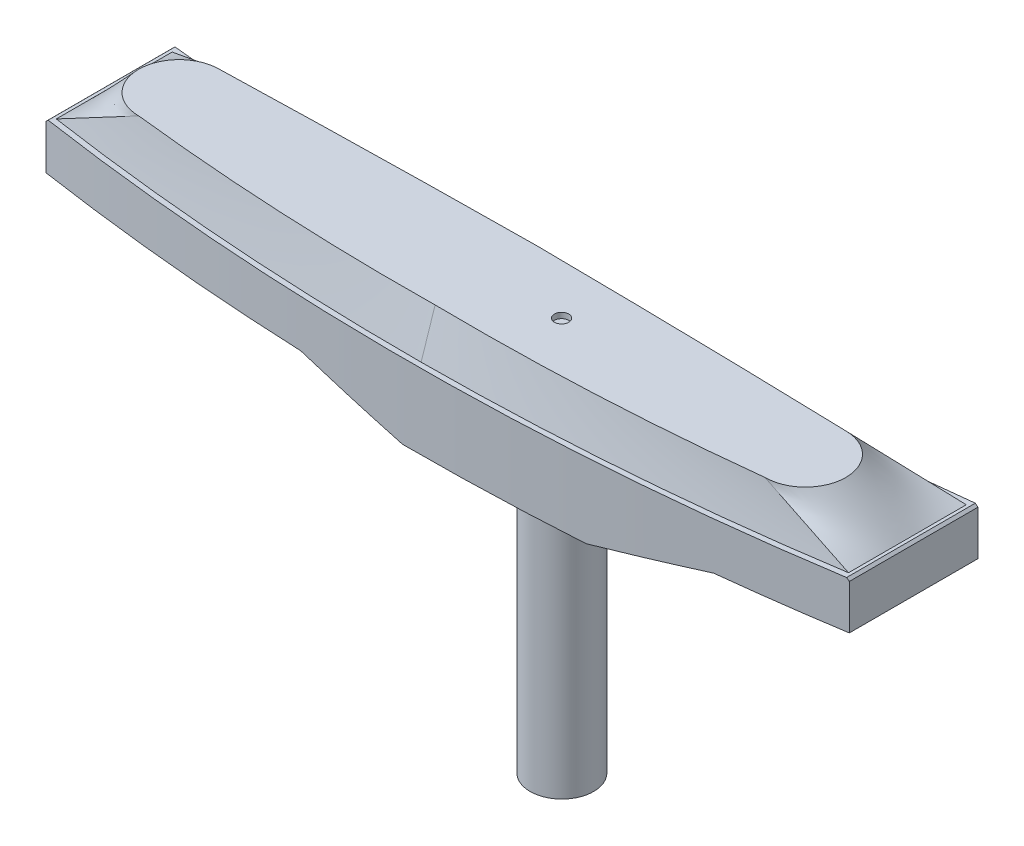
ISO-10303-21;
HEADER;
FILE_DESCRIPTION(('STEP AP214'),'2;1');
FILE_NAME('part.step','',(''),(''),'','','');
FILE_SCHEMA(('AUTOMOTIVE_DESIGN { 1 0 10303 214 1 1 1 1 }'));
ENDSEC;
DATA;
#1=APPLICATION_CONTEXT('core data for automotive mechanical design processes');
#2=APPLICATION_PROTOCOL_DEFINITION('international standard','automotive_design',2000,#1);
#3=PRODUCT_CONTEXT('',#1,'mechanical');
#4=PRODUCT('Part','Part','',(#3));
#5=PRODUCT_RELATED_PRODUCT_CATEGORY('part','',(#4));
#6=PRODUCT_DEFINITION_FORMATION('','',#4);
#7=PRODUCT_DEFINITION_CONTEXT('part definition',#1,'design');
#8=PRODUCT_DEFINITION('design','',#6,#7);
#9=PRODUCT_DEFINITION_SHAPE('','',#8);
#10=(LENGTH_UNIT() NAMED_UNIT(*) SI_UNIT(.MILLI.,.METRE.));
#11=(NAMED_UNIT(*) PLANE_ANGLE_UNIT() SI_UNIT($,.RADIAN.));
#12=(NAMED_UNIT(*) SI_UNIT($,.STERADIAN.) SOLID_ANGLE_UNIT());
#13=UNCERTAINTY_MEASURE_WITH_UNIT(LENGTH_MEASURE(1.E-05),#10,'distance_accuracy_value','');
#14=(GEOMETRIC_REPRESENTATION_CONTEXT(3) GLOBAL_UNCERTAINTY_ASSIGNED_CONTEXT((#13)) GLOBAL_UNIT_ASSIGNED_CONTEXT((#10,
#11,#12)) REPRESENTATION_CONTEXT('',''));
#15=CARTESIAN_POINT('',(0.,0.,0.));
#16=DIRECTION('',(0.,0.,1.));
#17=DIRECTION('',(1.,0.,0.));
#18=AXIS2_PLACEMENT_3D('',#15,#16,#17);
#19=CARTESIAN_POINT('',(89.4617446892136,128.447272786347,-41.));
#20=DIRECTION('',(0.,-1.,0.));
#21=DIRECTION('',(0.,0.,1.));
#22=AXIS2_PLACEMENT_3D('',#19,#20,#21);
#23=PLANE('',#22);
#24=DIRECTION('',(0.,0.,1.));
#25=VECTOR('',#24,1.);
#26=CARTESIAN_POINT('',(89.4617446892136,128.447272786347,-41.));
#27=LINE('',#26,#25);
#28=CARTESIAN_POINT('',(89.4617446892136,128.447272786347,-34.2392456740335));
#29=VERTEX_POINT('',#28);
#30=CARTESIAN_POINT('',(89.4617446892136,128.447272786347,-9.71667776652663));
#31=VERTEX_POINT('',#30);
#32=EDGE_CURVE('E262',#29,#31,#27,.T.);
#33=ORIENTED_EDGE('',*,*,#32,.F.);
#34=CARTESIAN_POINT('',(88.1460786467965,128.447272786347,-664.5294804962));
#35=DIRECTION('',(0.,1.,0.));
#36=DIRECTION('',(0.,0.,1.));
#37=AXIS2_PLACEMENT_3D('',#34,#35,#36);
#38=CIRCLE('',#37,630.291607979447);
#39=CARTESIAN_POINT('',(121.725900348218,128.447272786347,-35.1330182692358));
#40=VERTEX_POINT('',#39);
#41=EDGE_CURVE('E249',#29,#40,#38,.T.);
#42=ORIENTED_EDGE('',*,*,#41,.T.);
#43=DIRECTION('',(0.,0.,1.));
#44=VECTOR('',#43,1.);
#45=CARTESIAN_POINT('',(121.725900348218,128.447272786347,-41.));
#46=LINE('',#45,#44);
#47=CARTESIAN_POINT('',(121.725900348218,128.447272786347,-10.7554225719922));
#48=VERTEX_POINT('',#47);
#49=EDGE_CURVE('E265',#40,#48,#46,.T.);
#50=ORIENTED_EDGE('',*,*,#49,.T.);
#51=CARTESIAN_POINT('',(90.2256837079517,128.447272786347,-487.581419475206));
#52=DIRECTION('',(0.,1.,0.));
#53=DIRECTION('',(0.,0.,1.));
#54=AXIS2_PLACEMENT_3D('',#51,#52,#53);
#55=CIRCLE('',#54,477.865352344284);
#56=EDGE_CURVE('E231',#48,#31,#55,.F.);
#57=ORIENTED_EDGE('',*,*,#56,.T.);
#58=EDGE_LOOP('',(#33,#42,#50,#57));
#59=FACE_BOUND('',#58,.T.);
#60=CARTESIAN_POINT('',(105.593822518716,128.447272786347,-22.4973341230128));
#61=DIRECTION('',(0.,1.,0.));
#62=DIRECTION('',(0.,0.,1.));
#63=AXIS2_PLACEMENT_3D('',#60,#61,#62);
#64=CIRCLE('',#63,5.77113497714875);
#65=CARTESIAN_POINT('',(105.593822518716,128.447272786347,-16.7261991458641));
#66=VERTEX_POINT('',#65);
#67=EDGE_CURVE('E428',#66,#66,#64,.T.);
#68=ORIENTED_EDGE('',*,*,#67,.T.);
#69=EDGE_LOOP('',(#68));
#70=FACE_BOUND('',#69,.T.);
#71=ADVANCED_FACE('F34',(#59,#70),#23,.T.);
#72=CARTESIAN_POINT('',(28.1748364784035,150.036801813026,-40.));
#73=DIRECTION('',(-0.697545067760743,0.716540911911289,0.));
#74=DIRECTION('',(0.716540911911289,0.697545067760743,0.));
#75=AXIS2_PLACEMENT_3D('',#72,#73,#74);
#76=PLANE('',#75);
#77=DIRECTION('',(0.,0.,-1.));
#78=VECTOR('',#77,1.);
#79=CARTESIAN_POINT('',(19.956977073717,142.036801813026,-40.));
#80=LINE('',#79,#78);
#81=CARTESIAN_POINT('',(19.956977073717,142.036801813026,-14.9107055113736));
#82=VERTEX_POINT('',#81);
#83=CARTESIAN_POINT('',(19.956977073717,142.036801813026,-37.9373025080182));
#84=VERTEX_POINT('',#83);
#85=EDGE_CURVE('E205',#82,#84,#80,.T.);
#86=ORIENTED_EDGE('',*,*,#85,.T.);
#87=CARTESIAN_POINT('',(88.1460786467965,208.418177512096,-664.5294804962));
#88=DIRECTION('',(0.697545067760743,-0.716540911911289,0.));
#89=DIRECTION('',(0.716540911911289,0.697545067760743,0.));
#90=AXIS2_PLACEMENT_3D('',#87,#88,#89);
#91=ELLIPSE('',#90,879.631012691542,630.291607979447);
#92=CARTESIAN_POINT('',(19.503823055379,141.59566112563,-37.9867829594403));
#93=VERTEX_POINT('',#92);
#94=EDGE_CURVE('E216',#84,#93,#91,.T.);
#95=ORIENTED_EDGE('',*,*,#94,.T.);
#96=DIRECTION('',(0.,0.,1.));
#97=VECTOR('',#96,1.);
#98=CARTESIAN_POINT('',(19.503823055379,141.59566112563,-40.));
#99=LINE('',#98,#97);
#100=CARTESIAN_POINT('',(19.503823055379,141.59566112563,-14.9782948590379));
#101=VERTEX_POINT('',#100);
#102=EDGE_CURVE('E42',#93,#101,#99,.T.);
#103=ORIENTED_EDGE('',*,*,#102,.T.);
#104=CARTESIAN_POINT('',(90.2256837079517,210.442651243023,-487.581419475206));
#105=DIRECTION('',(0.697545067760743,-0.716540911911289,0.));
#106=DIRECTION('',(0.716540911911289,0.697545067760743,0.));
#107=AXIS2_PLACEMENT_3D('',#104,#105,#106);
#108=ELLIPSE('',#107,666.905886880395,477.865352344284);
#109=EDGE_CURVE('E219',#101,#82,#108,.F.);
#110=ORIENTED_EDGE('',*,*,#109,.T.);
#111=EDGE_LOOP('',(#86,#95,#103,#110));
#112=FACE_BOUND('',#111,.T.);
#113=ADVANCED_FACE('F36',(#112),#76,.T.);
#114=CARTESIAN_POINT('',(164.696110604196,141.59566112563,-40.));
#115=DIRECTION('',(0.716540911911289,0.697545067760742,0.));
#116=DIRECTION('',(0.697545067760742,-0.716540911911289,0.));
#117=AXIS2_PLACEMENT_3D('',#114,#115,#116);
#118=PLANE('',#117);
#119=DIRECTION('',(0.,0.,1.));
#120=VECTOR('',#119,1.);
#121=CARTESIAN_POINT('',(164.266664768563,142.036801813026,-40.));
#122=LINE('',#121,#120);
#123=CARTESIAN_POINT('',(164.266664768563,142.036801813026,-38.8513144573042));
#124=VERTEX_POINT('',#123);
#125=CARTESIAN_POINT('',(164.266664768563,142.036801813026,-15.4869076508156));
#126=VERTEX_POINT('',#125);
#127=EDGE_CURVE('E197',#124,#126,#122,.T.);
#128=ORIENTED_EDGE('',*,*,#127,.T.);
#129=CARTESIAN_POINT('',(90.2256837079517,218.09409838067,-487.581419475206));
#130=DIRECTION('',(-0.716540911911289,-0.697545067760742,0.));
#131=DIRECTION('',(-0.697545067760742,0.716540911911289,0.));
#132=AXIS2_PLACEMENT_3D('',#129,#130,#131);
#133=ELLIPSE('',#132,685.067351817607,477.865352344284);
#134=CARTESIAN_POINT('',(164.696110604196,141.59566112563,-15.5544599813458));
#135=VERTEX_POINT('',#134);
#136=EDGE_CURVE('E213',#126,#135,#133,.F.);
#137=ORIENTED_EDGE('',*,*,#136,.T.);
#138=DIRECTION('',(0.,0.,1.));
#139=VECTOR('',#138,1.);
#140=CARTESIAN_POINT('',(164.696110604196,141.59566112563,-40.));
#141=LINE('',#140,#139);
#142=CARTESIAN_POINT('',(164.696110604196,141.59566112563,-38.9037108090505));
#143=VERTEX_POINT('',#142);
#144=EDGE_CURVE('E258',#143,#135,#141,.T.);
#145=ORIENTED_EDGE('',*,*,#144,.F.);
#146=CARTESIAN_POINT('',(88.1460786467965,220.230336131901,-664.5294804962));
#147=DIRECTION('',(-0.716540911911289,-0.697545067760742,0.));
#148=DIRECTION('',(-0.697545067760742,0.716540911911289,0.));
#149=AXIS2_PLACEMENT_3D('',#146,#147,#148);
#150=ELLIPSE('',#149,903.585498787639,630.291607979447);
#151=EDGE_CURVE('E210',#143,#124,#150,.T.);
#152=ORIENTED_EDGE('',*,*,#151,.T.);
#153=EDGE_LOOP('',(#128,#137,#145,#152));
#154=FACE_BOUND('',#153,.T.);
#155=ADVANCED_FACE('F287',(#154),#118,.T.);
#156=CARTESIAN_POINT('',(164.696110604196,133.502486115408,-41.));
#157=DIRECTION('',(1.,0.,0.));
#158=DIRECTION('',(0.,0.,-1.));
#159=AXIS2_PLACEMENT_3D('',#156,#157,#158);
#160=PLANE('',#159);
#161=DIRECTION('',(0.,0.,1.));
#162=VECTOR('',#161,1.);
#163=CARTESIAN_POINT('',(164.696110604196,133.502486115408,-41.));
#164=LINE('',#163,#162);
#165=CARTESIAN_POINT('',(164.696110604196,133.502486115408,-38.9037108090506));
#166=VERTEX_POINT('',#165);
#167=CARTESIAN_POINT('',(164.696110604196,133.502486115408,-15.5544599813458));
#168=VERTEX_POINT('',#167);
#169=EDGE_CURVE('E254',#166,#168,#164,.T.);
#170=ORIENTED_EDGE('',*,*,#169,.F.);
#171=DIRECTION('',(0.,1.,0.));
#172=VECTOR('',#171,1.);
#173=CARTESIAN_POINT('',(164.696110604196,128.446272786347,-38.9037108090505));
#174=LINE('',#173,#172);
#175=EDGE_CURVE('E240',#166,#143,#174,.T.);
#176=ORIENTED_EDGE('',*,*,#175,.T.);
#177=ORIENTED_EDGE('',*,*,#144,.T.);
#178=DIRECTION('',(0.,1.,0.));
#179=VECTOR('',#178,1.);
#180=CARTESIAN_POINT('',(164.696110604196,128.446272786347,-15.5544599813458));
#181=LINE('',#180,#179);
#182=EDGE_CURVE('E237',#168,#135,#181,.T.);
#183=ORIENTED_EDGE('',*,*,#182,.F.);
#184=EDGE_LOOP('',(#170,#176,#177,#183));
#185=FACE_BOUND('',#184,.T.);
#186=ADVANCED_FACE('F283',(#185),#160,.T.);
#187=CARTESIAN_POINT('',(19.503823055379,141.59566112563,-41.));
#188=DIRECTION('',(-1.,0.,0.));
#189=DIRECTION('',(0.,1.,0.));
#190=AXIS2_PLACEMENT_3D('',#187,#188,#189);
#191=PLANE('',#190);
#192=ORIENTED_EDGE('',*,*,#102,.F.);
#193=DIRECTION('',(0.,1.,0.));
#194=VECTOR('',#193,1.);
#195=CARTESIAN_POINT('',(19.503823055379,128.446272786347,-37.9867829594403));
#196=LINE('',#195,#194);
#197=CARTESIAN_POINT('',(19.503823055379,133.502486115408,-37.9867829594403));
#198=VERTEX_POINT('',#197);
#199=EDGE_CURVE('E242',#198,#93,#196,.T.);
#200=ORIENTED_EDGE('',*,*,#199,.F.);
#201=DIRECTION('',(0.,0.,1.));
#202=VECTOR('',#201,1.);
#203=CARTESIAN_POINT('',(19.503823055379,133.502486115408,-41.));
#204=LINE('',#203,#202);
#205=CARTESIAN_POINT('',(19.503823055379,133.502486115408,-14.9782948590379));
#206=VERTEX_POINT('',#205);
#207=EDGE_CURVE('E255',#198,#206,#204,.T.);
#208=ORIENTED_EDGE('',*,*,#207,.T.);
#209=DIRECTION('',(0.,1.,0.));
#210=VECTOR('',#209,1.);
#211=CARTESIAN_POINT('',(19.503823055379,128.446272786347,-14.9782948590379));
#212=LINE('',#211,#210);
#213=EDGE_CURVE('E236',#206,#101,#212,.T.);
#214=ORIENTED_EDGE('',*,*,#213,.T.);
#215=EDGE_LOOP('',(#192,#200,#208,#214));
#216=FACE_BOUND('',#215,.T.);
#217=ADVANCED_FACE('F306',(#216),#191,.T.);
#218=CARTESIAN_POINT('',(19.503823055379,133.502486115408,-41.));
#219=DIRECTION('',(0.,-1.,0.));
#220=DIRECTION('',(0.,0.,1.));
#221=AXIS2_PLACEMENT_3D('',#218,#219,#220);
#222=PLANE('',#221);
#223=ORIENTED_EDGE('',*,*,#207,.F.);
#224=CARTESIAN_POINT('',(88.1460786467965,133.502486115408,-664.5294804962));
#225=DIRECTION('',(0.,1.,0.));
#226=DIRECTION('',(0.,0.,1.));
#227=AXIS2_PLACEMENT_3D('',#224,#225,#226);
#228=CIRCLE('',#227,630.291607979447);
#229=CARTESIAN_POINT('',(70.5790360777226,133.502486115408,-34.482728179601));
#230=VERTEX_POINT('',#229);
#231=EDGE_CURVE('E222',#198,#230,#228,.T.);
#232=ORIENTED_EDGE('',*,*,#231,.T.);
#233=DIRECTION('',(0.,0.,1.));
#234=VECTOR('',#233,1.);
#235=CARTESIAN_POINT('',(70.5790360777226,133.502486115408,-41.));
#236=LINE('',#235,#234);
#237=CARTESIAN_POINT('',(70.5790360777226,133.502486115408,-10.1201077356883));
#238=VERTEX_POINT('',#237);
#239=EDGE_CURVE('E259',#230,#238,#236,.T.);
#240=ORIENTED_EDGE('',*,*,#239,.T.);
#241=CARTESIAN_POINT('',(90.2256837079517,133.502486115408,-487.581419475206));
#242=DIRECTION('',(0.,1.,0.));
#243=DIRECTION('',(0.,0.,1.));
#244=AXIS2_PLACEMENT_3D('',#241,#242,#243);
#245=CIRCLE('',#244,477.865352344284);
#246=EDGE_CURVE('E225',#238,#206,#245,.F.);
#247=ORIENTED_EDGE('',*,*,#246,.T.);
#248=EDGE_LOOP('',(#223,#232,#240,#247));
#249=FACE_BOUND('',#248,.T.);
#250=ADVANCED_FACE('F308',(#249),#222,.T.);
#251=CARTESIAN_POINT('',(70.5790360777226,133.502486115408,-41.));
#252=DIRECTION('',(-0.25860935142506,-0.965981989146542,0.));
#253=DIRECTION('',(-0.965981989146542,0.25860935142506,0.));
#254=AXIS2_PLACEMENT_3D('',#251,#252,#253);
#255=PLANE('',#254);
#256=ORIENTED_EDGE('',*,*,#239,.F.);
#257=CARTESIAN_POINT('',(88.1460786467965,128.79949834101,-664.5294804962));
#258=DIRECTION('',(0.25860935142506,0.965981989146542,0.));
#259=DIRECTION('',(-0.965981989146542,0.25860935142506,0.));
#260=AXIS2_PLACEMENT_3D('',#257,#258,#259);
#261=ELLIPSE('',#260,652.48795014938,630.291607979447);
#262=EDGE_CURVE('E252',#230,#29,#261,.T.);
#263=ORIENTED_EDGE('',*,*,#262,.T.);
#264=ORIENTED_EDGE('',*,*,#32,.T.);
#265=CARTESIAN_POINT('',(90.2256837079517,128.242753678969,-487.581419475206));
#266=DIRECTION('',(0.25860935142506,0.965981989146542,0.));
#267=DIRECTION('',(-0.965981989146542,0.25860935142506,0.));
#268=AXIS2_PLACEMENT_3D('',#265,#266,#267);
#269=ELLIPSE('',#268,494.693853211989,477.865352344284);
#270=EDGE_CURVE('E234',#31,#238,#269,.F.);
#271=ORIENTED_EDGE('',*,*,#270,.T.);
#272=EDGE_LOOP('',(#256,#263,#264,#271));
#273=FACE_BOUND('',#272,.T.);
#274=ADVANCED_FACE('F311',(#273),#255,.T.);
#275=CARTESIAN_POINT('',(121.725900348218,128.447272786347,-41.));
#276=DIRECTION('',(0.231313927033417,-0.972879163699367,0.));
#277=DIRECTION('',(-0.972879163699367,-0.231313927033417,0.));
#278=AXIS2_PLACEMENT_3D('',#275,#276,#277);
#279=PLANE('',#278);
#280=ORIENTED_EDGE('',*,*,#49,.F.);
#281=CARTESIAN_POINT('',(88.1460786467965,120.46325923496,-664.5294804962));
#282=DIRECTION('',(-0.231313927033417,0.972879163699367,0.));
#283=DIRECTION('',(0.972879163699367,0.231313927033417,0.));
#284=AXIS2_PLACEMENT_3D('',#281,#282,#283);
#285=ELLIPSE('',#284,647.862171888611,630.291607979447);
#286=CARTESIAN_POINT('',(142.987532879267,133.502486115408,-36.628273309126));
#287=VERTEX_POINT('',#286);
#288=EDGE_CURVE('E246',#40,#287,#285,.T.);
#289=ORIENTED_EDGE('',*,*,#288,.T.);
#290=DIRECTION('',(0.,0.,1.));
#291=VECTOR('',#290,1.);
#292=CARTESIAN_POINT('',(142.987532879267,133.502486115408,-41.));
#293=LINE('',#292,#291);
#294=CARTESIAN_POINT('',(142.987532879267,133.502486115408,-12.6377572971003));
#295=VERTEX_POINT('',#294);
#296=EDGE_CURVE('E268',#287,#295,#293,.T.);
#297=ORIENTED_EDGE('',*,*,#296,.T.);
#298=CARTESIAN_POINT('',(90.2256837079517,120.957710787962,-487.581419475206));
#299=DIRECTION('',(-0.231313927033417,0.972879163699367,0.));
#300=DIRECTION('',(0.972879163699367,0.231313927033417,0.));
#301=AXIS2_PLACEMENT_3D('',#298,#299,#300);
#302=ELLIPSE('',#301,491.186747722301,477.865352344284);
#303=EDGE_CURVE('E229',#295,#48,#302,.F.);
#304=ORIENTED_EDGE('',*,*,#303,.T.);
#305=EDGE_LOOP('',(#280,#289,#297,#304));
#306=FACE_BOUND('',#305,.T.);
#307=ADVANCED_FACE('F318',(#306),#279,.T.);
#308=CARTESIAN_POINT('',(142.987532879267,133.502486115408,-41.));
#309=DIRECTION('',(0.,-1.,0.));
#310=DIRECTION('',(0.,0.,1.));
#311=AXIS2_PLACEMENT_3D('',#308,#309,#310);
#312=PLANE('',#311);
#313=ORIENTED_EDGE('',*,*,#296,.F.);
#314=CARTESIAN_POINT('',(88.1460786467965,133.502486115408,-664.5294804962));
#315=DIRECTION('',(0.,1.,0.));
#316=DIRECTION('',(0.,0.,1.));
#317=AXIS2_PLACEMENT_3D('',#314,#315,#316);
#318=CIRCLE('',#317,630.291607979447);
#319=EDGE_CURVE('E239',#287,#166,#318,.T.);
#320=ORIENTED_EDGE('',*,*,#319,.T.);
#321=ORIENTED_EDGE('',*,*,#169,.T.);
#322=CARTESIAN_POINT('',(90.2256837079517,133.502486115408,-487.581419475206));
#323=DIRECTION('',(0.,1.,0.));
#324=DIRECTION('',(0.,0.,1.));
#325=AXIS2_PLACEMENT_3D('',#322,#323,#324);
#326=CIRCLE('',#325,477.865352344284);
#327=EDGE_CURVE('E227',#168,#295,#326,.F.);
#328=ORIENTED_EDGE('',*,*,#327,.T.);
#329=EDGE_LOOP('',(#313,#320,#321,#328));
#330=FACE_BOUND('',#329,.T.);
#331=ADVANCED_FACE('F295',(#330),#312,.T.);
#332=CARTESIAN_POINT('',(88.1460786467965,128.446272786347,-664.5294804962));
#333=DIRECTION('',(0.,1.,0.));
#334=DIRECTION('',(1.,0.,0.));
#335=AXIS2_PLACEMENT_3D('',#332,#333,#334);
#336=CYLINDRICAL_SURFACE('',#335,630.291607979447);
#337=CARTESIAN_POINT('',(88.1460786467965,142.036801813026,-664.5294804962));
#338=DIRECTION('',(0.,1.,0.));
#339=DIRECTION('',(-1.,0.,0.));
#340=AXIS2_PLACEMENT_3D('',#337,#338,#339);
#341=CIRCLE('',#340,630.291607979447);
#342=EDGE_CURVE('E208',#84,#124,#341,.T.);
#343=ORIENTED_EDGE('',*,*,#342,.T.);
#344=ORIENTED_EDGE('',*,*,#151,.F.);
#345=ORIENTED_EDGE('',*,*,#175,.F.);
#346=ORIENTED_EDGE('',*,*,#319,.F.);
#347=ORIENTED_EDGE('',*,*,#288,.F.);
#348=ORIENTED_EDGE('',*,*,#41,.F.);
#349=ORIENTED_EDGE('',*,*,#262,.F.);
#350=ORIENTED_EDGE('',*,*,#231,.F.);
#351=ORIENTED_EDGE('',*,*,#199,.T.);
#352=ORIENTED_EDGE('',*,*,#94,.F.);
#353=EDGE_LOOP('',(#343,#344,#345,#346,#347,#348,#349,#350,#351,#352));
#354=FACE_BOUND('',#353,.T.);
#355=ADVANCED_FACE('F297',(#354),#336,.F.);
#356=CARTESIAN_POINT('',(90.2256837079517,128.446272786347,-487.581419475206));
#357=DIRECTION('',(0.,1.,0.));
#358=DIRECTION('',(1.,0.,0.));
#359=AXIS2_PLACEMENT_3D('',#356,#357,#358);
#360=CYLINDRICAL_SURFACE('',#359,477.865352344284);
#361=CARTESIAN_POINT('',(90.2256837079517,142.036801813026,-487.581419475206));
#362=DIRECTION('',(0.,1.,0.));
#363=DIRECTION('',(-1.,0.,0.));
#364=AXIS2_PLACEMENT_3D('',#361,#362,#363);
#365=CIRCLE('',#364,477.865352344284);
#366=EDGE_CURVE('E11',#126,#82,#365,.F.);
#367=ORIENTED_EDGE('',*,*,#366,.T.);
#368=ORIENTED_EDGE('',*,*,#109,.F.);
#369=ORIENTED_EDGE('',*,*,#213,.F.);
#370=ORIENTED_EDGE('',*,*,#246,.F.);
#371=ORIENTED_EDGE('',*,*,#270,.F.);
#372=ORIENTED_EDGE('',*,*,#56,.F.);
#373=ORIENTED_EDGE('',*,*,#303,.F.);
#374=ORIENTED_EDGE('',*,*,#327,.F.);
#375=ORIENTED_EDGE('',*,*,#182,.T.);
#376=ORIENTED_EDGE('',*,*,#136,.F.);
#377=EDGE_LOOP('',(#367,#368,#369,#370,#371,#372,#373,#374,#375,#376));
#378=FACE_BOUND('',#377,.T.);
#379=ADVANCED_FACE('F289',(#378),#360,.T.);
#380=CARTESIAN_POINT('',(8.4284544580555,142.036801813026,8.59458058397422));
#381=DIRECTION('',(0.,-1.,0.));
#382=DIRECTION('',(-1.,0.,0.));
#383=AXIS2_PLACEMENT_3D('',#380,#381,#382);
#384=PLANE('',#383);
#385=DIRECTION('',(0.,0.,-1.));
#386=VECTOR('',#385,1.);
#387=CARTESIAN_POINT('',(20.503823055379,142.036801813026,-15.840572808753));
#388=LINE('',#387,#386);
#389=CARTESIAN_POINT('',(20.503823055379,142.036801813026,-15.840572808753));
#390=VERTEX_POINT('',#389);
#391=CARTESIAN_POINT('',(20.503823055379,142.036801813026,-36.8722336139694));
#392=VERTEX_POINT('',#391);
#393=EDGE_CURVE('E165',#390,#392,#388,.T.);
#394=ORIENTED_EDGE('',*,*,#393,.T.);
#395=CARTESIAN_POINT('',(88.1460786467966,142.036801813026,-664.529480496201));
#396=DIRECTION('',(0.,1.,0.));
#397=DIRECTION('',(-1.,0.,0.));
#398=AXIS2_PLACEMENT_3D('',#395,#396,#397);
#399=CIRCLE('',#398,631.291607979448);
#400=CARTESIAN_POINT('',(91.8391258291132,142.036801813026,-33.2486747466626));
#401=VERTEX_POINT('',#400);
#402=EDGE_CURVE('E173',#392,#401,#399,.T.);
#403=ORIENTED_EDGE('',*,*,#402,.T.);
#404=CARTESIAN_POINT('',(163.696110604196,142.036801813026,-37.7749137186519));
#405=VERTEX_POINT('',#404);
#406=EDGE_CURVE('E177',#401,#405,#399,.T.);
#407=ORIENTED_EDGE('',*,*,#406,.T.);
#408=DIRECTION('',(0.,0.,1.));
#409=VECTOR('',#408,1.);
#410=CARTESIAN_POINT('',(163.696110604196,142.036801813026,-16.4098364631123));
#411=LINE('',#410,#409);
#412=CARTESIAN_POINT('',(163.696110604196,142.036801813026,-16.4098364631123));
#413=VERTEX_POINT('',#412);
#414=EDGE_CURVE('E182',#405,#413,#411,.T.);
#415=ORIENTED_EDGE('',*,*,#414,.T.);
#416=CARTESIAN_POINT('',(90.2256837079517,142.036801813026,-487.581419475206));
#417=DIRECTION('',(0.,-1.,0.));
#418=DIRECTION('',(-1.,0.,0.));
#419=AXIS2_PLACEMENT_3D('',#416,#417,#418);
#420=CIRCLE('',#419,476.865352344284);
#421=CARTESIAN_POINT('',(91.8352158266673,142.036801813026,-10.7187834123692));
#422=VERTEX_POINT('',#421);
#423=EDGE_CURVE('E168',#413,#422,#420,.T.);
#424=ORIENTED_EDGE('',*,*,#423,.T.);
#425=EDGE_CURVE('E150',#422,#390,#420,.T.);
#426=ORIENTED_EDGE('',*,*,#425,.T.);
#427=EDGE_LOOP('',(#394,#403,#407,#415,#424,#426));
#428=FACE_BOUND('',#427,.T.);
#429=ORIENTED_EDGE('',*,*,#342,.F.);
#430=ORIENTED_EDGE('',*,*,#85,.F.);
#431=ORIENTED_EDGE('',*,*,#366,.F.);
#432=ORIENTED_EDGE('',*,*,#127,.F.);
#433=EDGE_LOOP('',(#429,#430,#431,#432));
#434=FACE_BOUND('',#433,.T.);
#435=ADVANCED_FACE('F163',(#428,#434),#384,.F.);
#436=CARTESIAN_POINT('',(92.3029104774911,150.036801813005,-465.750662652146));
#437=DIRECTION('',(0.,-1.,0.));
#438=DIRECTION('',(-1.,0.,0.));
#439=AXIS2_PLACEMENT_3D('',#436,#437,#438);
#440=PLANE('',#439);
#441=CARTESIAN_POINT('',(105.649988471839,150.036801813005,-22.3863500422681));
#442=DIRECTION('',(0.,-1.,0.));
#443=DIRECTION('',(1.,0.,0.));
#444=AXIS2_PLACEMENT_3D('',#441,#442,#443);
#445=CIRCLE('',#444,1.29851496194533);
#446=CARTESIAN_POINT('',(106.948503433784,150.036801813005,-22.3863500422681));
#447=VERTEX_POINT('',#446);
#448=EDGE_CURVE('E429',#447,#447,#445,.T.);
#449=ORIENTED_EDGE('',*,*,#448,.T.);
#450=EDGE_LOOP('',(#449));
#451=FACE_BOUND('',#450,.T.);
#452=CARTESIAN_POINT('',(86.2829924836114,150.036801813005,-465.753360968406));
#453=DIRECTION('',(0.,-1.,0.));
#454=DIRECTION('',(-1.,0.,0.));
#455=AXIS2_PLACEMENT_3D('',#452,#453,#454);
#456=CIRCLE('',#455,452.80541776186);
#457=CARTESIAN_POINT('',(92.0999668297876,150.036801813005,-12.9853086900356));
#458=VERTEX_POINT('',#457);
#459=CARTESIAN_POINT('',(35.5155345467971,150.036801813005,-15.8029020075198));
#460=VERTEX_POINT('',#459);
#461=EDGE_CURVE('E153',#458,#460,#456,.T.);
#462=ORIENTED_EDGE('',*,*,#461,.F.);
#463=CARTESIAN_POINT('',(98.3228284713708,150.036801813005,-465.747964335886));
#464=DIRECTION('',(0.,-1.,0.));
#465=DIRECTION('',(1.,0.,0.));
#466=AXIS2_PLACEMENT_3D('',#463,#464,#465);
#467=CIRCLE('',#466,452.80541776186);
#468=CARTESIAN_POINT('',(149.138054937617,150.036801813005,-15.8029020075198));
#469=VERTEX_POINT('',#468);
#470=EDGE_CURVE('E188',#469,#458,#467,.T.);
#471=ORIENTED_EDGE('',*,*,#470,.F.);
#472=CARTESIAN_POINT('',(149.152610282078,150.036801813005,-23.1290258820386));
#473=DIRECTION('',(0.,-1.,0.));
#474=DIRECTION('',(-1.,0.,0.));
#475=AXIS2_PLACEMENT_3D('',#472,#473,#474);
#476=CIRCLE('',#475,7.32613833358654);
#477=CARTESIAN_POINT('',(149.109727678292,150.036801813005,-30.4550387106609));
#478=VERTEX_POINT('',#477);
#479=EDGE_CURVE('E191',#478,#469,#476,.T.);
#480=ORIENTED_EDGE('',*,*,#479,.F.);
#481=CARTESIAN_POINT('',(67.3266992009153,150.036801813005,2823.6792120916));
#482=DIRECTION('',(0.,-1.,0.));
#483=DIRECTION('',(-1.,0.,0.));
#484=AXIS2_PLACEMENT_3D('',#481,#482,#483);
#485=CIRCLE('',#484,2855.30572537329);
#486=CARTESIAN_POINT('',(92.0999668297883,150.036801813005,-31.5190420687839));
#487=VERTEX_POINT('',#486);
#488=EDGE_CURVE('E195',#487,#478,#485,.T.);
#489=ORIENTED_EDGE('',*,*,#488,.F.);
#490=CARTESIAN_POINT('',(117.527094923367,150.036801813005,2823.67346396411));
#491=DIRECTION('',(0.,-1.,0.));
#492=DIRECTION('',(1.,0.,0.));
#493=AXIS2_PLACEMENT_3D('',#490,#491,#492);
#494=CIRCLE('',#493,2855.30572537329);
#495=CARTESIAN_POINT('',(35.5438618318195,150.036801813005,-30.4550431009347));
#496=VERTEX_POINT('',#495);
#497=EDGE_CURVE('E192',#496,#487,#494,.T.);
#498=ORIENTED_EDGE('',*,*,#497,.F.);
#499=CARTESIAN_POINT('',(35.5009792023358,150.036801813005,-23.1290258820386));
#500=DIRECTION('',(0.,-1.,0.));
#501=DIRECTION('',(1.,0.,0.));
#502=AXIS2_PLACEMENT_3D('',#499,#500,#501);
#503=CIRCLE('',#502,7.32613833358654);
#504=EDGE_CURVE('E194',#460,#496,#503,.T.);
#505=ORIENTED_EDGE('',*,*,#504,.F.);
#506=EDGE_LOOP('',(#462,#471,#480,#489,#498,#505));
#507=FACE_BOUND('',#506,.T.);
#508=ADVANCED_FACE('F343',(#451,#507),#440,.F.);
#509=CARTESIAN_POINT('',(35.5155350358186,150.036801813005,-15.8029063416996));
#510=CARTESIAN_POINT('',(20.503823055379,142.036801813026,-15.840572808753));
#511=CARTESIAN_POINT('',(54.3058485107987,150.036801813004,-13.6828141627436));
#512=CARTESIAN_POINT('',(44.13033972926,142.036801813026,-12.348645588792));
#513=CARTESIAN_POINT('',(73.1919880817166,150.036801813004,-12.7423868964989));
#514=CARTESIAN_POINT('',(67.9521811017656,142.036801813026,-10.6381721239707));
#515=CARTESIAN_POINT('',(92.0999668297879,150.036801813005,-12.9853086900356));
#516=CARTESIAN_POINT('',(91.8352158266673,142.036801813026,-10.7187834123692));
#517=(BOUNDED_SURFACE() B_SPLINE_SURFACE(3,1,((#509,#510),(#511,#512),(#513,#514),(#515,#516)),
.UNSPECIFIED.,.F.,.F.,.F.) B_SPLINE_SURFACE_WITH_KNOTS((4,4),(2,2),(0.,1.),(0.,1.),
.UNSPECIFIED.) GEOMETRIC_REPRESENTATION_ITEM() RATIONAL_B_SPLINE_SURFACE(((1.,1.),
(0.998694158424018,0.998123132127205),(0.998694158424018,0.998123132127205),(1.,1.))) REPRESENTATION_ITEM('') SURFACE());
#518=DIRECTION('',(0.882503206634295,0.470301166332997,0.00221432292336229));
#519=VECTOR('',#518,1.);
#520=CARTESIAN_POINT('',(28.0096790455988,146.036801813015,-15.8217395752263));
#521=LINE('',#520,#519);
#522=EDGE_CURVE('E147',#390,#460,#521,.T.);
#523=DIRECTION('',(-0.0318245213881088,-0.961643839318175,0.272448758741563));
#524=VECTOR('',#523,1.);
#525=CARTESIAN_POINT('',(91.9675913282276,146.036801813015,-11.8520460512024));
#526=LINE('',#525,#524);
#527=EDGE_CURVE('E158',#458,#422,#526,.T.);
#528=ORIENTED_EDGE('',*,*,#461,.T.);
#529=ORIENTED_EDGE('',*,*,#522,.F.);
#530=ORIENTED_EDGE('',*,*,#425,.F.);
#531=ORIENTED_EDGE('',*,*,#527,.F.);
#532=EDGE_LOOP('',(#528,#529,#530,#531));
#533=FACE_BOUND('',#532,.T.);
#534=ADVANCED_FACE('F149',(#533),#517,.F.);
#535=CARTESIAN_POINT('',(92.0999668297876,150.036801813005,-12.9853086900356));
#536=CARTESIAN_POINT('',(91.8352158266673,142.036801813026,-10.7187834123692));
#537=CARTESIAN_POINT('',(111.15933708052,150.036801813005,-12.7233528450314));
#538=CARTESIAN_POINT('',(115.909620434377,142.036801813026,-10.8000406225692));
#539=CARTESIAN_POINT('',(130.197293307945,150.036801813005,-13.6637984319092));
#540=CARTESIAN_POINT('',(139.909018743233,142.036801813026,-12.7006828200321));
#541=CARTESIAN_POINT('',(149.138054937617,150.036801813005,-15.8029020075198));
#542=CARTESIAN_POINT('',(163.696110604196,142.036801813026,-16.4098364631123));
#543=(BOUNDED_SURFACE() B_SPLINE_SURFACE(3,1,((#535,#536),(#537,#538),(#539,#540),(#541,#542)),
.UNSPECIFIED.,.F.,.F.,.F.) B_SPLINE_SURFACE_WITH_KNOTS((4,4),(2,2),(0.,1.),(0.,1.),
.UNSPECIFIED.) GEOMETRIC_REPRESENTATION_ITEM() RATIONAL_B_SPLINE_SURFACE(((1.,1.),
(0.998673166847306,0.998093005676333),(0.998673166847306,0.998093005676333),(1.,1.))) REPRESENTATION_ITEM('') SURFACE());
#544=DIRECTION('',(0.875807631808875,-0.481277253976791,-0.036512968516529));
#545=VECTOR('',#544,1.);
#546=CARTESIAN_POINT('',(156.417082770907,146.036801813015,-16.1063692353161));
#547=LINE('',#546,#545);
#548=EDGE_CURVE('E159',#469,#413,#547,.T.);
#549=ORIENTED_EDGE('',*,*,#470,.T.);
#550=ORIENTED_EDGE('',*,*,#527,.T.);
#551=ORIENTED_EDGE('',*,*,#423,.F.);
#552=ORIENTED_EDGE('',*,*,#548,.F.);
#553=EDGE_LOOP('',(#549,#550,#551,#552));
#554=FACE_BOUND('',#553,.T.);
#555=ADVANCED_FACE('F351',(#554),#543,.F.);
#556=CARTESIAN_POINT('',(35.5438618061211,150.036801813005,-30.4550387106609));
#557=CARTESIAN_POINT('',(20.503823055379,142.036801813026,-36.8722336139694));
#558=CARTESIAN_POINT('',(31.2390321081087,150.036801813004,-30.4802369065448));
#559=CARTESIAN_POINT('',(20.503823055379,142.036801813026,-33.3669568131));
#560=CARTESIAN_POINT('',(28.1831772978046,150.036801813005,-27.4480850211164));
#561=CARTESIAN_POINT('',(20.503823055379,142.036801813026,-29.8616800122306));
#562=CARTESIAN_POINT('',(28.166531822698,150.036801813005,-18.8382942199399));
#563=CARTESIAN_POINT('',(20.503823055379,142.036801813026,-22.8511264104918));
#564=CARTESIAN_POINT('',(31.2106395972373,150.036801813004,-15.7943491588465));
#565=CARTESIAN_POINT('',(20.503823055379,142.036801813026,-19.3458496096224));
#566=CARTESIAN_POINT('',(35.5155345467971,150.036801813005,-15.8029020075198));
#567=CARTESIAN_POINT('',(20.503823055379,142.036801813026,-15.840572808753));
#568=(BOUNDED_SURFACE() B_SPLINE_SURFACE(3,1,((#556,#557),(#558,#559),(#560,#561),(#562,#563),
(#564,#565),(#566,#567)),.UNSPECIFIED.,.F.,.F.,.F.) B_SPLINE_SURFACE_WITH_KNOTS((4,2,4),(2,2),
(0.,0.5,1.),(0.,1.),
.UNSPECIFIED.) GEOMETRIC_REPRESENTATION_ITEM() RATIONAL_B_SPLINE_SURFACE(((1.,1.),
(0.646115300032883,1.),(0.519355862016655,1.),(0.519355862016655,1.),(0.646115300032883,1.),(1.,1.))) REPRESENTATION_ITEM('') SURFACE());
#569=DIRECTION('',(0.826197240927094,0.439465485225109,0.35251695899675));
#570=VECTOR('',#569,1.);
#571=CARTESIAN_POINT('',(28.0238424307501,146.036801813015,-33.6636361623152));
#572=LINE('',#571,#570);
#573=EDGE_CURVE('E172',#392,#496,#572,.T.);
#574=ORIENTED_EDGE('',*,*,#504,.T.);
#575=ORIENTED_EDGE('',*,*,#573,.F.);
#576=ORIENTED_EDGE('',*,*,#393,.F.);
#577=ORIENTED_EDGE('',*,*,#522,.T.);
#578=EDGE_LOOP('',(#574,#575,#576,#577));
#579=FACE_BOUND('',#578,.T.);
#580=ADVANCED_FACE('F171',(#579),#568,.F.);
#581=CARTESIAN_POINT('',(149.138054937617,150.036801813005,-15.8029020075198));
#582=CARTESIAN_POINT('',(163.696110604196,142.036801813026,-16.4098364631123));
#583=CARTESIAN_POINT('',(153.442949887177,150.036801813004,-15.7943491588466));
#584=CARTESIAN_POINT('',(163.696110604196,142.036801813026,-19.9706826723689));
#585=CARTESIAN_POINT('',(156.487057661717,150.036801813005,-18.8382942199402));
#586=CARTESIAN_POINT('',(163.696110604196,142.036801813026,-23.5315288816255));
#587=CARTESIAN_POINT('',(156.470412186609,150.036801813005,-27.4480850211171));
#588=CARTESIAN_POINT('',(163.696110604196,142.036801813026,-30.6532213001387));
#589=CARTESIAN_POINT('',(153.414557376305,150.036801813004,-30.4802369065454));
#590=CARTESIAN_POINT('',(163.696110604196,142.036801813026,-34.2140675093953));
#591=CARTESIAN_POINT('',(149.109727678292,150.036801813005,-30.4550387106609));
#592=CARTESIAN_POINT('',(163.696110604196,142.036801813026,-37.7749137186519));
#593=(BOUNDED_SURFACE() B_SPLINE_SURFACE(3,1,((#581,#582),(#583,#584),(#585,#586),(#587,#588),
(#589,#590),(#591,#592)),.UNSPECIFIED.,.F.,.F.,.F.) B_SPLINE_SURFACE_WITH_KNOTS((4,2,4),(2,2),
(0.,0.5,1.),(0.,1.),
.UNSPECIFIED.) GEOMETRIC_REPRESENTATION_ITEM() RATIONAL_B_SPLINE_SURFACE(((1.,1.),
(0.646115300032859,1.),(0.519355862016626,1.),(0.519355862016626,1.),(0.646115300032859,1.),(1.,1.))) REPRESENTATION_ITEM('') SURFACE());
#594=DIRECTION('',(0.802536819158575,-0.440156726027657,-0.402736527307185));
#595=VECTOR('',#594,1.);
#596=CARTESIAN_POINT('',(156.402919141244,146.036801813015,-34.1149762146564));
#597=LINE('',#596,#595);
#598=EDGE_CURVE('E175',#478,#405,#597,.T.);
#599=ORIENTED_EDGE('',*,*,#479,.T.);
#600=ORIENTED_EDGE('',*,*,#548,.T.);
#601=ORIENTED_EDGE('',*,*,#414,.F.);
#602=ORIENTED_EDGE('',*,*,#598,.F.);
#603=EDGE_LOOP('',(#599,#600,#601,#602));
#604=FACE_BOUND('',#603,.T.);
#605=ADVANCED_FACE('F371',(#604),#593,.F.);
#606=CARTESIAN_POINT('',(92.0999668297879,150.036801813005,-31.5190420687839));
#607=CARTESIAN_POINT('',(91.8391258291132,142.036801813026,-33.2486747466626));
#608=CARTESIAN_POINT('',(73.2447268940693,150.036801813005,-31.3511253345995));
#609=CARTESIAN_POINT('',(68.004994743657,142.036801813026,-33.1092430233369));
#610=CARTESIAN_POINT('',(54.3920752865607,150.036801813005,-30.9964474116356));
#611=CARTESIAN_POINT('',(44.2011459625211,142.036801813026,-34.3183869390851));
#612=CARTESIAN_POINT('',(35.5438618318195,150.036801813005,-30.4550431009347));
#613=CARTESIAN_POINT('',(20.503823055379,142.036801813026,-36.8722336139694));
#614=(BOUNDED_SURFACE() B_SPLINE_SURFACE(3,1,((#606,#607),(#608,#609),(#610,#611),(#612,#613)),
.UNSPECIFIED.,.F.,.F.,.F.) B_SPLINE_SURFACE_WITH_KNOTS((4,4),(2,2),(0.,1.),(0.,1.),
.UNSPECIFIED.) GEOMETRIC_REPRESENTATION_ITEM() RATIONAL_B_SPLINE_SURFACE(((1.,1.),
(0.999967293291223,0.998932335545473),(0.999967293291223,0.998932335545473),(1.,1.))) REPRESENTATION_ITEM('') SURFACE());
#615=DIRECTION('',(0.0318526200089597,0.976920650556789,0.211214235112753));
#616=VECTOR('',#615,1.);
#617=CARTESIAN_POINT('',(91.9695463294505,146.036801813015,-32.3838584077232));
#618=LINE('',#617,#616);
#619=EDGE_CURVE('E49',#401,#487,#618,.T.);
#620=ORIENTED_EDGE('',*,*,#497,.T.);
#621=ORIENTED_EDGE('',*,*,#619,.F.);
#622=ORIENTED_EDGE('',*,*,#402,.F.);
#623=ORIENTED_EDGE('',*,*,#573,.T.);
#624=EDGE_LOOP('',(#620,#621,#622,#623));
#625=FACE_BOUND('',#624,.T.);
#626=ADVANCED_FACE('F381',(#625),#614,.F.);
#627=CARTESIAN_POINT('',(149.109727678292,150.036801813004,-30.4550387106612));
#628=CARTESIAN_POINT('',(163.696110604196,142.036801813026,-37.7749137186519));
#629=CARTESIAN_POINT('',(130.110331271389,150.036801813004,-30.9994518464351));
#630=CARTESIAN_POINT('',(139.842919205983,142.036801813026,-34.8996105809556));
#631=CARTESIAN_POINT('',(111.106446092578,150.036801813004,-31.3541314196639));
#632=CARTESIAN_POINT('',(115.864578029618,142.036801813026,-33.3892257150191));
#633=CARTESIAN_POINT('',(92.0999668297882,150.036801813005,-31.5190420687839));
#634=CARTESIAN_POINT('',(91.8391258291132,142.036801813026,-33.2486747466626));
#635=(BOUNDED_SURFACE() B_SPLINE_SURFACE(3,1,((#627,#628),(#629,#630),(#631,#632),(#633,#634)),
.UNSPECIFIED.,.F.,.F.,.F.) B_SPLINE_SURFACE_WITH_KNOTS((4,4),(2,2),(0.,1.),(0.,1.),
.UNSPECIFIED.) GEOMETRIC_REPRESENTATION_ITEM() RATIONAL_B_SPLINE_SURFACE(((1.,1.),
(0.999966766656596,0.998915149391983),(0.999966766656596,0.998915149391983),(1.,1.))) REPRESENTATION_ITEM('') SURFACE());
#636=ORIENTED_EDGE('',*,*,#488,.T.);
#637=ORIENTED_EDGE('',*,*,#598,.T.);
#638=ORIENTED_EDGE('',*,*,#406,.F.);
#639=ORIENTED_EDGE('',*,*,#619,.T.);
#640=EDGE_LOOP('',(#636,#637,#638,#639));
#641=FACE_BOUND('',#640,.T.);
#642=ADVANCED_FACE('F392',(#641),#635,.F.);
#643=CARTESIAN_POINT('',(105.593822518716,78.4472727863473,-22.4973341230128));
#644=DIRECTION('',(0.,1.,0.));
#645=DIRECTION('',(0.,0.,-1.));
#646=AXIS2_PLACEMENT_3D('',#643,#644,#645);
#647=CYLINDRICAL_SURFACE('',#646,5.77113497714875);
#648=CARTESIAN_POINT('',(105.593822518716,78.4472727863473,-22.4973341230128));
#649=DIRECTION('',(0.,1.,0.));
#650=DIRECTION('',(0.,0.,1.));
#651=AXIS2_PLACEMENT_3D('',#648,#649,#650);
#652=CIRCLE('',#651,5.77113497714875);
#653=CARTESIAN_POINT('',(105.593822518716,78.4472727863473,-16.7261991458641));
#654=VERTEX_POINT('',#653);
#655=EDGE_CURVE('E169',#654,#654,#652,.T.);
#656=ORIENTED_EDGE('',*,*,#655,.T.);
#657=EDGE_LOOP('',(#656));
#658=FACE_BOUND('',#657,.T.);
#659=ORIENTED_EDGE('',*,*,#67,.F.);
#660=EDGE_LOOP('',(#659));
#661=FACE_BOUND('',#660,.T.);
#662=ADVANCED_FACE('F402',(#658,#661),#647,.T.);
#663=CARTESIAN_POINT('',(105.593822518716,78.4472727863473,-22.4973341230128));
#664=DIRECTION('',(0.,-1.,0.));
#665=DIRECTION('',(0.,0.,1.));
#666=AXIS2_PLACEMENT_3D('',#663,#664,#665);
#667=PLANE('',#666);
#668=ORIENTED_EDGE('',*,*,#655,.F.);
#669=EDGE_LOOP('',(#668));
#670=FACE_BOUND('',#669,.T.);
#671=ADVANCED_FACE('F411',(#670),#667,.T.);
#672=CARTESIAN_POINT('',(105.649988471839,149.036801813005,-22.3863500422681));
#673=DIRECTION('',(0.,1.,0.));
#674=DIRECTION('',(1.,0.,0.));
#675=AXIS2_PLACEMENT_3D('',#672,#673,#674);
#676=CYLINDRICAL_SURFACE('',#675,1.29851496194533);
#677=CARTESIAN_POINT('',(105.649988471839,149.036801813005,-22.3863500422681));
#678=DIRECTION('',(0.,-1.,0.));
#679=DIRECTION('',(1.,0.,0.));
#680=AXIS2_PLACEMENT_3D('',#677,#678,#679);
#681=CIRCLE('',#680,1.29851496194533);
#682=CARTESIAN_POINT('',(106.948503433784,149.036801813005,-22.3863500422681));
#683=VERTEX_POINT('',#682);
#684=EDGE_CURVE('E427',#683,#683,#681,.T.);
#685=ORIENTED_EDGE('',*,*,#684,.T.);
#686=EDGE_LOOP('',(#685));
#687=FACE_BOUND('',#686,.T.);
#688=ORIENTED_EDGE('',*,*,#448,.F.);
#689=EDGE_LOOP('',(#688));
#690=FACE_BOUND('',#689,.T.);
#691=ADVANCED_FACE('F415',(#687,#690),#676,.F.);
#692=CARTESIAN_POINT('',(105.649988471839,149.036801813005,-22.3863500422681));
#693=DIRECTION('',(0.,1.,0.));
#694=DIRECTION('',(1.,0.,0.));
#695=AXIS2_PLACEMENT_3D('',#692,#693,#694);
#696=PLANE('',#695);
#697=ORIENTED_EDGE('',*,*,#684,.F.);
#698=EDGE_LOOP('',(#697));
#699=FACE_BOUND('',#698,.T.);
#700=ADVANCED_FACE('F419',(#699),#696,.T.);
#701=CLOSED_SHELL('',(#71,#113,#155,#186,#217,#250,#274,#307,#331,#355,#379,#435,#508,#534,#555,
#580,#605,#626,#642,#662,#671,#691,#700));
#702=MANIFOLD_SOLID_BREP('B2',#701);
#703=ADVANCED_BREP_SHAPE_REPRESENTATION('',(#18,#702),#14);
#704=SHAPE_DEFINITION_REPRESENTATION(#9,#703);
ENDSEC;
END-ISO-10303-21;
